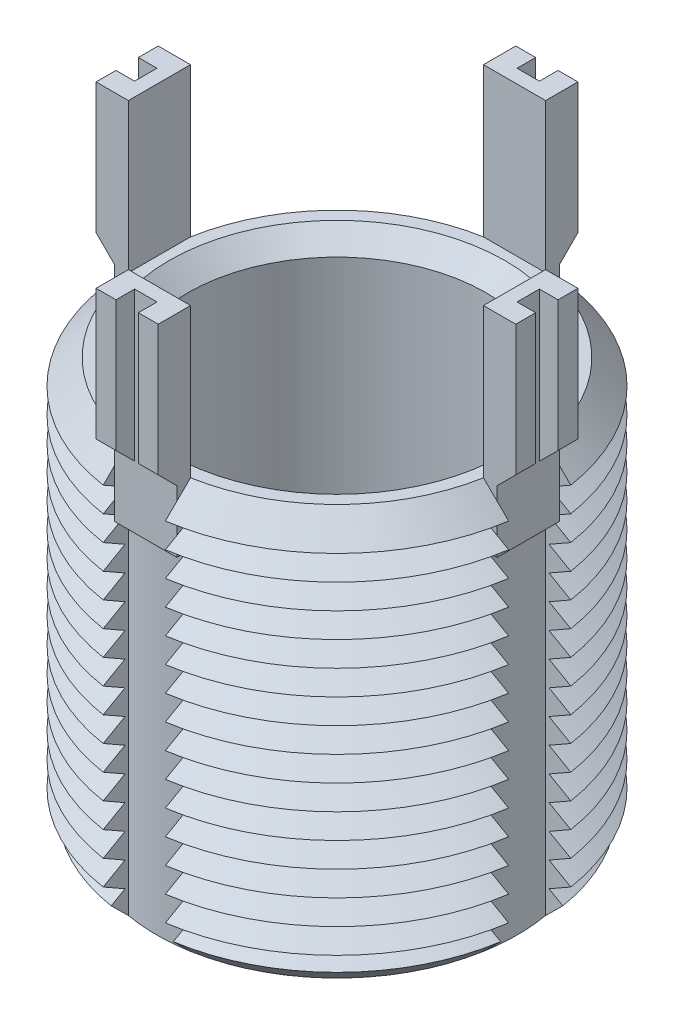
from build123d import *

# Parameters (mm, degrees)
SKETCH1_R               = 16.5
BOSS_EXTRUDE1_DEPTH     = 33
CHAMFER1_SIZE           = 2
LPATTERN1_COUNT         = 15
LPATTERN1_PITCH         = 2
CUT_EXTRUDE1_REACH      = 42.417
CIRPATTERN1_COUNT       = 4
BOSS_EXTRUDE3_DEPTH     = 2.5
CIRPATTERN2_COUNT       = 4
CUT_EXTRUDE3_DEPTH      = 51.941748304
CUT_EXTRUDE3_DEPTH_BACK = 51.941748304
SKETCH6_W               = 1.5
SKETCH6_H               = 1.8
SKETCH6_W_2             = 1.8
SKETCH6_H_2             = 1.5
SKETCH7_R               = 12
CUT_EXTRUDE4_DEPTH      = 33
CHAMFER2_SIZE           = 1.5


with BuildPart() as part:
    # Sketch1 → Boss-Extrude1 (new body)
    with BuildSketch(Plane(origin=(0, 0, 0), x_dir=(1, 0, 0), z_dir=(0, 1, 0))):
        with Locations(Location((0, 0, 0), (0, 0, 270))):
            Circle(SKETCH1_R)
    extrude(amount=-BOSS_EXTRUDE1_DEPTH)

    # Chamfer1
    chamfer1_edges = [part.edges().sort_by_distance(p)[0] for p in [
        (0, 0, -16.5),
        (0, -33, -16.5),
    ]]
    chamfer(chamfer1_edges, length=CHAMFER1_SIZE)

    # Sketch3 → Cut-Revolve1 (revolve, cut)
    with BuildSketch(Plane(origin=(0, 0, 0), x_dir=(0, 0, -1), z_dir=(1, 0, 0))):
        Polygon((-16.5, -2), (-14.767949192, -3), (-16.5, -4), align=None)
    cut_revolve1 = revolve(axis=Axis((0, 0.885892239, 0), (0, -1, 0)), mode=Mode.SUBTRACT)

    # LPattern1: Cut-Revolve1 ×15
    with Locations(*[(0, -i * LPATTERN1_PITCH, 0) for i in range(1, LPATTERN1_COUNT)]):
        add(cut_revolve1, mode=Mode.SUBTRACT)

    # Cut-Extrude1: up to this cone (the profile starts inside it)
    cut_extrude1_end = Plane(origin=(0, 0, 0), z_dir=(0, 1, 0)).offset(-47.499999) * Cone(1e-06, 137.917, 137.916999, align=(Align.CENTER, Align.CENTER, Align.MIN), mode=Mode.PRIVATE)
    # Sketch4 → Cut-Extrude1 (cut, up to the surface)
    with BuildSketch(Plane(origin=(0, 0, 0), x_dir=(1, 0, 0), z_dir=(0, 1, 0)), mode=Mode.PRIVATE) as cut_extrude1_sk1:
        with BuildLine():
            Line((-14.282856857, 2.5), (-16.30950643, 2.5))
            ThreePointArc((-16.30950643, 2.5), (-16.5, 0), (-16.30950643, -2.5))
            Line((-16.30950643, -2.5), (-14.282856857, -2.5))
            ThreePointArc((-14.282856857, -2.5), (-14.5, 0), (-14.282856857, 2.5))
        make_face()
    cut_extrude1_tool1 = extrude(cut_extrude1_sk1.sketch, amount=-CUT_EXTRUDE1_REACH, mode=Mode.PRIVATE) & cut_extrude1_end
    cut_extrude1 = cut_extrude1_tool1.solids().sort_by_distance((-15.432004, 0, 0))[0]
    add(cut_extrude1, mode=Mode.SUBTRACT)

    # CirPattern1: Cut-Extrude1 ×4 about axis
    cirpattern1_axis = Axis((0, 0, 0), (0, 1, 0))
    for i in range(1, CIRPATTERN1_COUNT):
        add(cut_extrude1.rotate(cirpattern1_axis, i * 360 / CIRPATTERN1_COUNT), mode=Mode.SUBTRACT)

    # Sketch5 → Boss-Extrude3 (add, symmetric)
    with BuildSketch(Plane(origin=(0, 0, 0), x_dir=(0, 0, -1), z_dir=(1, 0, 0))):
        Polygon((-14.282856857, 12), (-14.282856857, -5), (-15.382856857, -5), (-15.382856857, 0), (-16.882856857, 1.5), (-16.882856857, 12), align=None)
    boss_extrude3 = extrude(amount=BOSS_EXTRUDE3_DEPTH, both=True)

    # CirPattern2: Boss-Extrude3 ×4 about axis
    cirpattern2_axis = Axis((0, 0, 0), (0, 1, 0))
    for i in range(1, CIRPATTERN2_COUNT):
        add(boss_extrude3.rotate(cirpattern2_axis, i * 360 / CIRPATTERN2_COUNT))

    # Sketch6 → Cut-Extrude3 (cut, two sides: drawn at the far end of the back side and taken through both)
    with BuildSketch(Plane(origin=(0, 12, 0), x_dir=(1, 0, 0), z_dir=(0, 1, 0)).offset(-CUT_EXTRUDE3_DEPTH_BACK)):
        with Locations((-16.132856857, 0)):
            Rectangle(SKETCH6_W, SKETCH6_H)
        with Locations((0, 16.132856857)):
            Rectangle(SKETCH6_W_2, SKETCH6_H_2)
        with Locations((16.132856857, 0)):
            Rectangle(SKETCH6_W, SKETCH6_H)
        with Locations((0, -16.132856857)):
            Rectangle(SKETCH6_W_2, SKETCH6_H_2)
    extrude(amount=CUT_EXTRUDE3_DEPTH + CUT_EXTRUDE3_DEPTH_BACK, mode=Mode.SUBTRACT)

    # Sketch7 → Cut-Extrude4 (cut)
    with BuildSketch(Plane(origin=(0, 0, 0), x_dir=(1, 0, 0), z_dir=(0, 1, 0))):
        with Locations(Location((0, 0, 0), (0, 0, 270))):
            Circle(SKETCH7_R)
    extrude(amount=-CUT_EXTRUDE4_DEPTH, mode=Mode.SUBTRACT)

    # Chamfer2
    chamfer2_edges = [part.edges().sort_by_distance(p)[0] for p in [
        (0, 0, -12),
        (0, -33, -12),
    ]]
    chamfer(chamfer2_edges, length=CHAMFER2_SIZE)


solid = part.part
